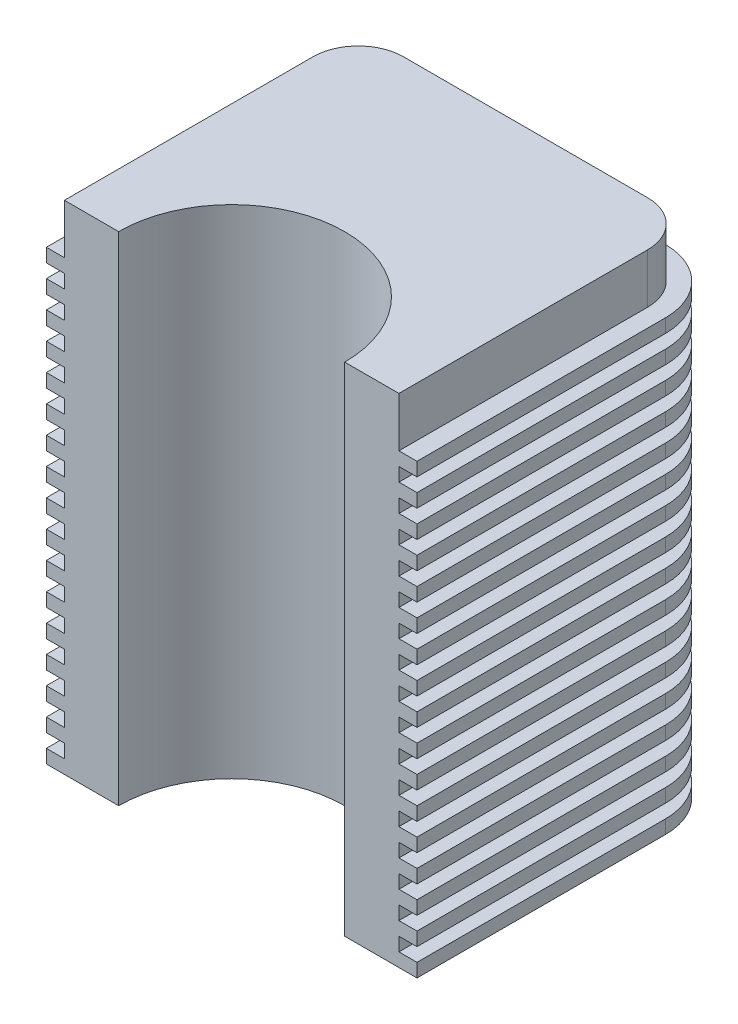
from build123d import *

# Parameters (mm, degrees)
BOSS_EXTRUDE1_DEPTH = 110
BOSS_EXTRUDE2_DEPTH = 3
LPATTERN1_COUNT     = 17
LPATTERN1_PITCH     = 6


with BuildPart() as part:
    # Sketch2 → Boss-Extrude1 (new body)
    with BuildSketch(Plane(origin=(0, 0, 0), x_dir=(1, 0, 0), z_dir=(0, 1, 0))):
        with BuildLine():
            Line((25, 0), (37, 0))
            Line((37, 0), (37, 55))
            ThreePointArc((37, 55), (34.071067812, 62.071067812), (27, 65))
            Line((27, 65), (-27, 65))
            ThreePointArc((-27, 65), (-34.071067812, 62.071067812), (-37, 55))
            Line((-37, 55), (-37, 0))
            Line((-37, 0), (-25, 0))
            ThreePointArc((-25, 0), (0, 25), (25, 0))
        make_face()
    extrude(amount=BOSS_EXTRUDE1_DEPTH)

    # Sketch3 → Boss-Extrude2 (add)
    with BuildSketch(Plane.XZ):
        with BuildLine():
            Line((-41, 0), (-41, -55))
            ThreePointArc((-41, -55), (-36.899494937, -64.899494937), (-27, -69))
            Line((-27, -69), (27, -69))
            ThreePointArc((27, -69), (36.899494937, -64.899494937), (41, -55))
            Line((41, -55), (41, 0))
            Line((41, 0), (37, 0))
            Line((37, 0), (37, -55))
            ThreePointArc((37, -55), (34.071067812, -62.071067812), (27, -65))
            Line((27, -65), (-27, -65))
            ThreePointArc((-27, -65), (-34.071067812, -62.071067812), (-37, -55))
            Line((-37, -55), (-37, 0))
            Line((-37, 0), (-41, 0))
        make_face()
    boss_extrude2 = extrude(amount=-BOSS_EXTRUDE2_DEPTH)

    # LPattern1: Boss-Extrude2 ×17
    with Locations(*[(0, i * LPATTERN1_PITCH, 0) for i in range(1, LPATTERN1_COUNT)]):
        add(boss_extrude2)


solid = part.part
